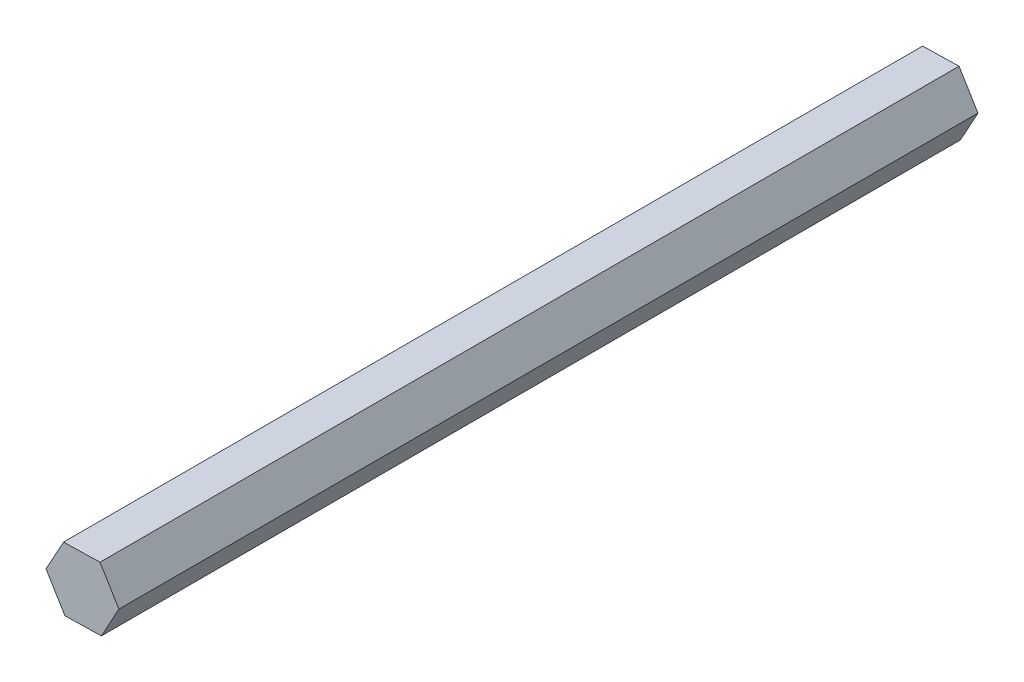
ISO-10303-21;
HEADER;
FILE_DESCRIPTION(('STEP AP214'),'2;1');
FILE_NAME('part.step','',(''),(''),'','','');
FILE_SCHEMA(('AUTOMOTIVE_DESIGN { 1 0 10303 214 1 1 1 1 }'));
ENDSEC;
DATA;
#1=APPLICATION_CONTEXT('core data for automotive mechanical design processes');
#2=APPLICATION_PROTOCOL_DEFINITION('international standard','automotive_design',2000,#1);
#3=PRODUCT_CONTEXT('',#1,'mechanical');
#4=PRODUCT('Part','Part','',(#3));
#5=PRODUCT_RELATED_PRODUCT_CATEGORY('part','',(#4));
#6=PRODUCT_DEFINITION_FORMATION('','',#4);
#7=PRODUCT_DEFINITION_CONTEXT('part definition',#1,'design');
#8=PRODUCT_DEFINITION('design','',#6,#7);
#9=PRODUCT_DEFINITION_SHAPE('','',#8);
#10=(LENGTH_UNIT() NAMED_UNIT(*) SI_UNIT(.MILLI.,.METRE.));
#11=(NAMED_UNIT(*) PLANE_ANGLE_UNIT() SI_UNIT($,.RADIAN.));
#12=(NAMED_UNIT(*) SI_UNIT($,.STERADIAN.) SOLID_ANGLE_UNIT());
#13=UNCERTAINTY_MEASURE_WITH_UNIT(LENGTH_MEASURE(1.E-05),#10,'distance_accuracy_value','');
#14=(GEOMETRIC_REPRESENTATION_CONTEXT(3) GLOBAL_UNCERTAINTY_ASSIGNED_CONTEXT((#13)) GLOBAL_UNIT_ASSIGNED_CONTEXT((#10,
#11,#12)) REPRESENTATION_CONTEXT('',''));
#15=CARTESIAN_POINT('',(0.,0.,0.));
#16=DIRECTION('',(0.,0.,1.));
#17=DIRECTION('',(1.,0.,0.));
#18=AXIS2_PLACEMENT_3D('',#15,#16,#17);
#19=CARTESIAN_POINT('',(-1.38788837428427,-2.53122484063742,-68.));
#20=DIRECTION('',(0.0220544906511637,-0.999756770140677,0.));
#21=DIRECTION('',(0.999756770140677,0.0220544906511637,0.));
#22=AXIS2_PLACEMENT_3D('',#19,#20,#21);
#23=PLANE('',#22);
#24=DIRECTION('',(0.999756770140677,0.0220544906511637,0.));
#25=VECTOR('',#24,1.);
#26=CARTESIAN_POINT('',(-1.38788837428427,-2.53122484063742,0.));
#27=LINE('',#26,#25);
#28=CARTESIAN_POINT('',(-1.38788837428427,-2.53122484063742,0.));
#29=VERTEX_POINT('',#28);
#30=CARTESIAN_POINT('',(1.49816082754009,-2.46755901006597,0.));
#31=VERTEX_POINT('',#30);
#32=EDGE_CURVE('E400',#29,#31,#27,.T.);
#33=ORIENTED_EDGE('',*,*,#32,.F.);
#34=DIRECTION('',(0.,0.,1.));
#35=VECTOR('',#34,1.);
#36=CARTESIAN_POINT('',(-1.38788837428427,-2.53122484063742,-68.));
#37=LINE('',#36,#35);
#38=CARTESIAN_POINT('',(-1.38788837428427,-2.53122484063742,-68.));
#39=VERTEX_POINT('',#38);
#40=EDGE_CURVE('E11',#39,#29,#37,.T.);
#41=ORIENTED_EDGE('',*,*,#40,.F.);
#42=DIRECTION('',(0.999756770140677,0.0220544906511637,0.));
#43=VECTOR('',#42,1.);
#44=CARTESIAN_POINT('',(-1.38788837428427,-2.53122484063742,-68.));
#45=LINE('',#44,#43);
#46=CARTESIAN_POINT('',(1.49816082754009,-2.46755901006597,-68.));
#47=VERTEX_POINT('',#46);
#48=EDGE_CURVE('E402',#39,#47,#45,.T.);
#49=ORIENTED_EDGE('',*,*,#48,.T.);
#50=DIRECTION('',(0.,0.,1.));
#51=VECTOR('',#50,1.);
#52=CARTESIAN_POINT('',(1.49816082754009,-2.46755901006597,-68.));
#53=LINE('',#52,#51);
#54=EDGE_CURVE('E351',#47,#31,#53,.T.);
#55=ORIENTED_EDGE('',*,*,#54,.T.);
#56=EDGE_LOOP('',(#33,#41,#49,#55));
#57=FACE_BOUND('',#56,.T.);
#58=ADVANCED_FACE('F348',(#57),#23,.T.);
#59=CARTESIAN_POINT('',(-2.88604920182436,-0.0636658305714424,-68.));
#60=DIRECTION('',(-0.854787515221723,-0.518978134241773,0.));
#61=DIRECTION('',(0.518978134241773,-0.854787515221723,0.));
#62=AXIS2_PLACEMENT_3D('',#59,#60,#61);
#63=PLANE('',#62);
#64=DIRECTION('',(0.518978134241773,-0.854787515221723,0.));
#65=VECTOR('',#64,1.);
#66=CARTESIAN_POINT('',(-2.88604920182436,-0.0636658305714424,0.));
#67=LINE('',#66,#65);
#68=CARTESIAN_POINT('',(-2.88604920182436,-0.0636658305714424,0.));
#69=VERTEX_POINT('',#68);
#70=EDGE_CURVE('E418',#69,#29,#67,.T.);
#71=ORIENTED_EDGE('',*,*,#70,.F.);
#72=DIRECTION('',(0.,0.,1.));
#73=VECTOR('',#72,1.);
#74=CARTESIAN_POINT('',(-2.88604920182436,-0.0636658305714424,-68.));
#75=LINE('',#74,#73);
#76=CARTESIAN_POINT('',(-2.88604920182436,-0.0636658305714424,-68.));
#77=VERTEX_POINT('',#76);
#78=EDGE_CURVE('E356',#77,#69,#75,.T.);
#79=ORIENTED_EDGE('',*,*,#78,.F.);
#80=DIRECTION('',(0.518978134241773,-0.854787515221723,0.));
#81=VECTOR('',#80,1.);
#82=CARTESIAN_POINT('',(-2.88604920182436,-0.0636658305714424,-68.));
#83=LINE('',#82,#81);
#84=EDGE_CURVE('E407',#77,#39,#83,.T.);
#85=ORIENTED_EDGE('',*,*,#84,.T.);
#86=ORIENTED_EDGE('',*,*,#40,.T.);
#87=EDGE_LOOP('',(#71,#79,#85,#86));
#88=FACE_BOUND('',#87,.T.);
#89=ADVANCED_FACE('F453',(#88),#63,.T.);
#90=CARTESIAN_POINT('',(-1.49816082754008,2.46755901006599,-68.));
#91=DIRECTION('',(-0.876842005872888,0.480778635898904,0.));
#92=DIRECTION('',(-0.480778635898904,-0.876842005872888,0.));
#93=AXIS2_PLACEMENT_3D('',#90,#91,#92);
#94=PLANE('',#93);
#95=DIRECTION('',(-0.480778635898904,-0.876842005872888,0.));
#96=VECTOR('',#95,1.);
#97=CARTESIAN_POINT('',(-1.49816082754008,2.46755901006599,0.));
#98=LINE('',#97,#96);
#99=CARTESIAN_POINT('',(-1.49816082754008,2.46755901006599,0.));
#100=VERTEX_POINT('',#99);
#101=EDGE_CURVE('E425',#100,#69,#98,.T.);
#102=ORIENTED_EDGE('',*,*,#101,.F.);
#103=DIRECTION('',(0.,0.,1.));
#104=VECTOR('',#103,1.);
#105=CARTESIAN_POINT('',(-1.49816082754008,2.46755901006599,-68.));
#106=LINE('',#105,#104);
#107=CARTESIAN_POINT('',(-1.49816082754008,2.46755901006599,-68.));
#108=VERTEX_POINT('',#107);
#109=EDGE_CURVE('E441',#108,#100,#106,.T.);
#110=ORIENTED_EDGE('',*,*,#109,.F.);
#111=DIRECTION('',(-0.480778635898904,-0.876842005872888,0.));
#112=VECTOR('',#111,1.);
#113=CARTESIAN_POINT('',(-1.49816082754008,2.46755901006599,-68.));
#114=LINE('',#113,#112);
#115=EDGE_CURVE('E437',#108,#77,#114,.T.);
#116=ORIENTED_EDGE('',*,*,#115,.T.);
#117=ORIENTED_EDGE('',*,*,#78,.T.);
#118=EDGE_LOOP('',(#102,#110,#116,#117));
#119=FACE_BOUND('',#118,.T.);
#120=ADVANCED_FACE('F458',(#119),#94,.T.);
#121=CARTESIAN_POINT('',(1.38788837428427,2.53122484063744,-68.));
#122=DIRECTION('',(-0.0220544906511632,0.999756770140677,0.));
#123=DIRECTION('',(-0.999756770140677,-0.0220544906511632,0.));
#124=AXIS2_PLACEMENT_3D('',#121,#122,#123);
#125=PLANE('',#124);
#126=DIRECTION('',(-0.999756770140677,-0.0220544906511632,0.));
#127=VECTOR('',#126,1.);
#128=CARTESIAN_POINT('',(1.38788837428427,2.53122484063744,0.));
#129=LINE('',#128,#127);
#130=CARTESIAN_POINT('',(1.38788837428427,2.53122484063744,0.));
#131=VERTEX_POINT('',#130);
#132=EDGE_CURVE('E422',#131,#100,#129,.T.);
#133=ORIENTED_EDGE('',*,*,#132,.F.);
#134=DIRECTION('',(0.,0.,1.));
#135=VECTOR('',#134,1.);
#136=CARTESIAN_POINT('',(1.38788837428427,2.53122484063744,-68.));
#137=LINE('',#136,#135);
#138=CARTESIAN_POINT('',(1.38788837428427,2.53122484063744,-68.));
#139=VERTEX_POINT('',#138);
#140=EDGE_CURVE('E443',#139,#131,#137,.T.);
#141=ORIENTED_EDGE('',*,*,#140,.F.);
#142=DIRECTION('',(-0.999756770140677,-0.0220544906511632,0.));
#143=VECTOR('',#142,1.);
#144=CARTESIAN_POINT('',(1.38788837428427,2.53122484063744,-68.));
#145=LINE('',#144,#143);
#146=EDGE_CURVE('E434',#139,#108,#145,.T.);
#147=ORIENTED_EDGE('',*,*,#146,.T.);
#148=ORIENTED_EDGE('',*,*,#109,.T.);
#149=EDGE_LOOP('',(#133,#141,#147,#148));
#150=FACE_BOUND('',#149,.T.);
#151=ADVANCED_FACE('F450',(#150),#125,.T.);
#152=CARTESIAN_POINT('',(2.88604920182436,0.0636658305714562,-68.));
#153=DIRECTION('',(0.854787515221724,0.518978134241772,0.));
#154=DIRECTION('',(-0.518978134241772,0.854787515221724,0.));
#155=AXIS2_PLACEMENT_3D('',#152,#153,#154);
#156=PLANE('',#155);
#157=DIRECTION('',(-0.518978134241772,0.854787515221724,0.));
#158=VECTOR('',#157,1.);
#159=CARTESIAN_POINT('',(2.88604920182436,0.0636658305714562,0.));
#160=LINE('',#159,#158);
#161=CARTESIAN_POINT('',(2.88604920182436,0.0636658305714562,0.));
#162=VERTEX_POINT('',#161);
#163=EDGE_CURVE('E414',#162,#131,#160,.T.);
#164=ORIENTED_EDGE('',*,*,#163,.F.);
#165=DIRECTION('',(0.,0.,1.));
#166=VECTOR('',#165,1.);
#167=CARTESIAN_POINT('',(2.88604920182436,0.0636658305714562,-68.));
#168=LINE('',#167,#166);
#169=CARTESIAN_POINT('',(2.88604920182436,0.0636658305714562,-68.));
#170=VERTEX_POINT('',#169);
#171=EDGE_CURVE('E406',#170,#162,#168,.T.);
#172=ORIENTED_EDGE('',*,*,#171,.F.);
#173=DIRECTION('',(-0.518978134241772,0.854787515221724,0.));
#174=VECTOR('',#173,1.);
#175=CARTESIAN_POINT('',(2.88604920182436,0.0636658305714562,-68.));
#176=LINE('',#175,#174);
#177=EDGE_CURVE('E431',#170,#139,#176,.T.);
#178=ORIENTED_EDGE('',*,*,#177,.T.);
#179=ORIENTED_EDGE('',*,*,#140,.T.);
#180=EDGE_LOOP('',(#164,#172,#178,#179));
#181=FACE_BOUND('',#180,.T.);
#182=ADVANCED_FACE('F446',(#181),#156,.T.);
#183=CARTESIAN_POINT('',(1.49816082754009,-2.46755901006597,-68.));
#184=DIRECTION('',(0.876842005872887,-0.480778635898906,0.));
#185=DIRECTION('',(0.480778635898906,0.876842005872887,0.));
#186=AXIS2_PLACEMENT_3D('',#183,#184,#185);
#187=PLANE('',#186);
#188=DIRECTION('',(0.480778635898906,0.876842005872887,0.));
#189=VECTOR('',#188,1.);
#190=CARTESIAN_POINT('',(1.49816082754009,-2.46755901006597,0.));
#191=LINE('',#190,#189);
#192=EDGE_CURVE('E409',#31,#162,#191,.T.);
#193=ORIENTED_EDGE('',*,*,#192,.F.);
#194=ORIENTED_EDGE('',*,*,#54,.F.);
#195=DIRECTION('',(0.480778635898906,0.876842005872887,0.));
#196=VECTOR('',#195,1.);
#197=CARTESIAN_POINT('',(1.49816082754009,-2.46755901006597,-68.));
#198=LINE('',#197,#196);
#199=EDGE_CURVE('E429',#47,#170,#198,.T.);
#200=ORIENTED_EDGE('',*,*,#199,.T.);
#201=ORIENTED_EDGE('',*,*,#171,.T.);
#202=EDGE_LOOP('',(#193,#194,#200,#201));
#203=FACE_BOUND('',#202,.T.);
#204=ADVANCED_FACE('F410',(#203),#187,.T.);
#205=CARTESIAN_POINT('',(4.38421002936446,-2.40389317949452,-68.));
#206=DIRECTION('',(0.,0.,1.));
#207=DIRECTION('',(1.,0.,0.));
#208=AXIS2_PLACEMENT_3D('',#205,#206,#207);
#209=PLANE('',#208);
#210=ORIENTED_EDGE('',*,*,#48,.F.);
#211=ORIENTED_EDGE('',*,*,#84,.F.);
#212=ORIENTED_EDGE('',*,*,#115,.F.);
#213=ORIENTED_EDGE('',*,*,#146,.F.);
#214=ORIENTED_EDGE('',*,*,#177,.F.);
#215=ORIENTED_EDGE('',*,*,#199,.F.);
#216=EDGE_LOOP('',(#210,#211,#212,#213,#214,#215));
#217=FACE_BOUND('',#216,.T.);
#218=ADVANCED_FACE('F457',(#217),#209,.F.);
#219=CARTESIAN_POINT('',(4.38421002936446,-2.40389317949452,0.));
#220=DIRECTION('',(0.,0.,1.));
#221=DIRECTION('',(1.,0.,0.));
#222=AXIS2_PLACEMENT_3D('',#219,#220,#221);
#223=PLANE('',#222);
#224=ORIENTED_EDGE('',*,*,#32,.T.);
#225=ORIENTED_EDGE('',*,*,#192,.T.);
#226=ORIENTED_EDGE('',*,*,#163,.T.);
#227=ORIENTED_EDGE('',*,*,#132,.T.);
#228=ORIENTED_EDGE('',*,*,#101,.T.);
#229=ORIENTED_EDGE('',*,*,#70,.T.);
#230=EDGE_LOOP('',(#224,#225,#226,#227,#228,#229));
#231=FACE_BOUND('',#230,.T.);
#232=ADVANCED_FACE('F416',(#231),#223,.T.);
#233=CLOSED_SHELL('',(#58,#89,#120,#151,#182,#204,#218,#232));
#234=MANIFOLD_SOLID_BREP('B2',#233);
#235=ADVANCED_BREP_SHAPE_REPRESENTATION('',(#18,#234),#14);
#236=SHAPE_DEFINITION_REPRESENTATION(#9,#235);
ENDSEC;
END-ISO-10303-21;
